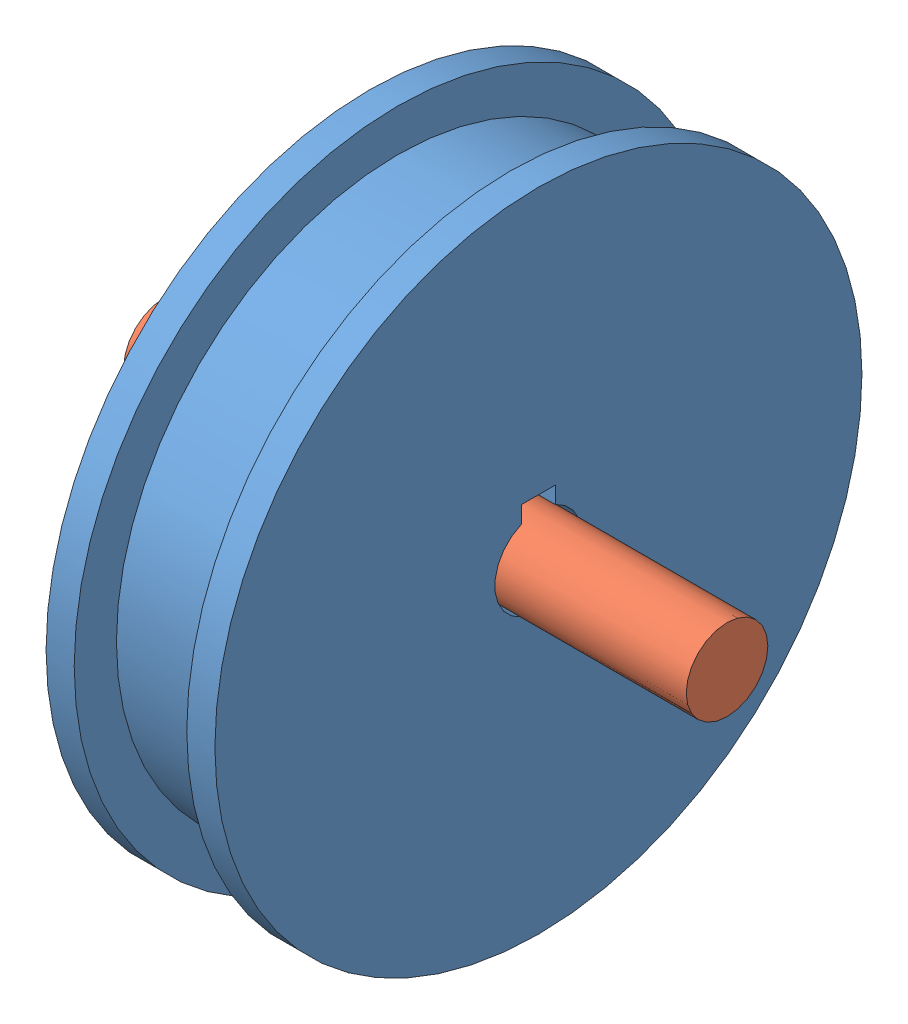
SolidWorks assembly rad-oben.SLDASM, configuration 默认 (file format 6000). Lengths in mm.
Overall size (20 23 23).
2 component instances, 2 part files, 2 mates.
Components (placement in the parent):
- rad-2-1: rad-2.SLDPRT [默认] at (3.694 0.0745 23) size (6 23 23)
- achse-1-1: achse-1.SLDPRT [默认] at (3.3991 0.0745 23) size (20 3.41 2.9)
Mates (geometry in assembly coordinates):
- 同心1: concentric anti-aligned: cylinder of rad-2-1 through (0.694 0.0745 23) axis (1 0 0) radius 1.55; cylinder of achse-1-1 through (5.3991 0.0745 23) axis (-1 0 0) radius 1.45
- 平行1: parallel anti-aligned: plane of rad-2-1 through (0.694 2.1036 22.4) normal (0 -1 0); plane of achse-1-1 through (5.3991 2.0355 22.5) normal (0 1 0)
